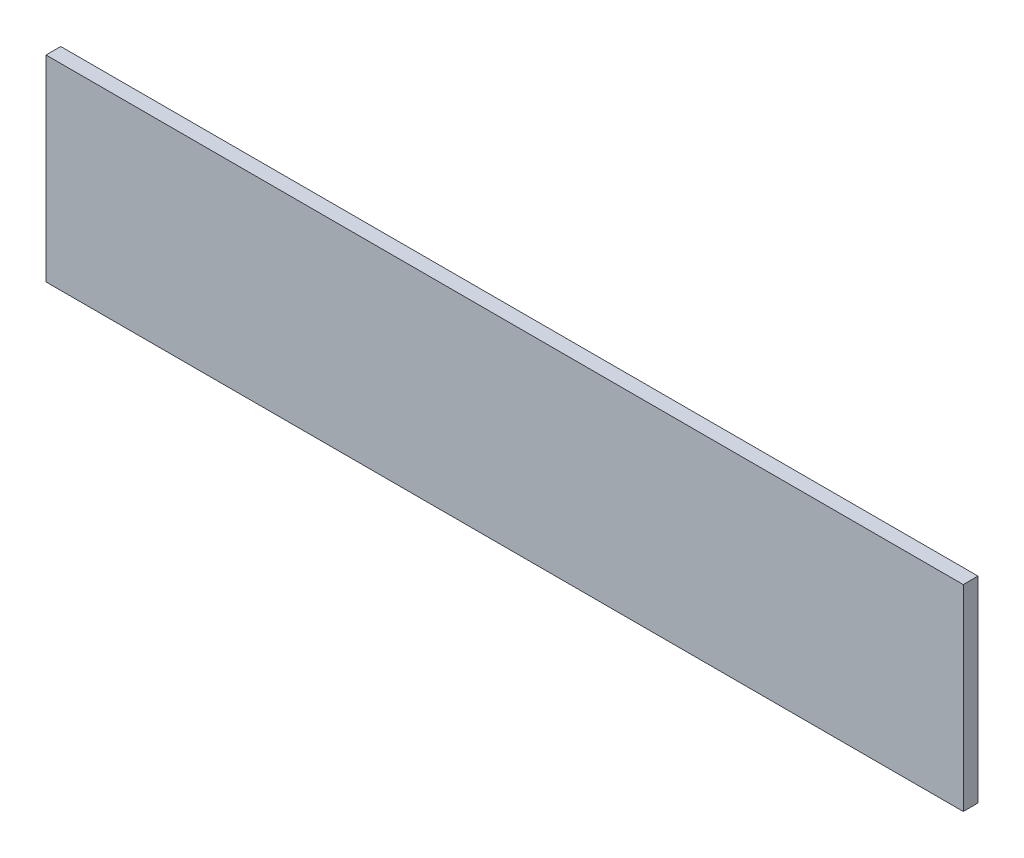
ISO-10303-21;
HEADER;
FILE_DESCRIPTION(('STEP AP214'),'2;1');
FILE_NAME('part.step','',(''),(''),'','','');
FILE_SCHEMA(('AUTOMOTIVE_DESIGN { 1 0 10303 214 1 1 1 1 }'));
ENDSEC;
DATA;
#1=APPLICATION_CONTEXT('core data for automotive mechanical design processes');
#2=APPLICATION_PROTOCOL_DEFINITION('international standard','automotive_design',2000,#1);
#3=PRODUCT_CONTEXT('',#1,'mechanical');
#4=PRODUCT('Part','Part','',(#3));
#5=PRODUCT_RELATED_PRODUCT_CATEGORY('part','',(#4));
#6=PRODUCT_DEFINITION_FORMATION('','',#4);
#7=PRODUCT_DEFINITION_CONTEXT('part definition',#1,'design');
#8=PRODUCT_DEFINITION('design','',#6,#7);
#9=PRODUCT_DEFINITION_SHAPE('','',#8);
#10=(LENGTH_UNIT() NAMED_UNIT(*) SI_UNIT(.MILLI.,.METRE.));
#11=(NAMED_UNIT(*) PLANE_ANGLE_UNIT() SI_UNIT($,.RADIAN.));
#12=(NAMED_UNIT(*) SI_UNIT($,.STERADIAN.) SOLID_ANGLE_UNIT());
#13=UNCERTAINTY_MEASURE_WITH_UNIT(LENGTH_MEASURE(1.E-05),#10,'distance_accuracy_value','');
#14=(GEOMETRIC_REPRESENTATION_CONTEXT(3) GLOBAL_UNCERTAINTY_ASSIGNED_CONTEXT((#13)) GLOBAL_UNIT_ASSIGNED_CONTEXT((#10,
#11,#12)) REPRESENTATION_CONTEXT('',''));
#15=CARTESIAN_POINT('',(0.,0.,0.));
#16=DIRECTION('',(0.,0.,1.));
#17=DIRECTION('',(1.,0.,0.));
#18=AXIS2_PLACEMENT_3D('',#15,#16,#17);
#19=CARTESIAN_POINT('',(-140.,-30.,4.5));
#20=DIRECTION('',(1.,0.,0.));
#21=DIRECTION('',(0.,0.,-1.));
#22=AXIS2_PLACEMENT_3D('',#19,#20,#21);
#23=PLANE('',#22);
#24=DIRECTION('',(0.,-1.,0.));
#25=VECTOR('',#24,1.);
#26=CARTESIAN_POINT('',(-140.,-30.,0.));
#27=LINE('',#26,#25);
#28=CARTESIAN_POINT('',(-140.,30.,0.));
#29=VERTEX_POINT('',#28);
#30=CARTESIAN_POINT('',(-140.,-30.,0.));
#31=VERTEX_POINT('',#30);
#32=EDGE_CURVE('E96',#29,#31,#27,.T.);
#33=ORIENTED_EDGE('',*,*,#32,.T.);
#34=DIRECTION('',(0.,0.,-1.));
#35=VECTOR('',#34,1.);
#36=CARTESIAN_POINT('',(-140.,-30.,4.5));
#37=LINE('',#36,#35);
#38=CARTESIAN_POINT('',(-140.,-30.,4.5));
#39=VERTEX_POINT('',#38);
#40=EDGE_CURVE('E11',#39,#31,#37,.T.);
#41=ORIENTED_EDGE('',*,*,#40,.F.);
#42=DIRECTION('',(0.,-1.,0.));
#43=VECTOR('',#42,1.);
#44=CARTESIAN_POINT('',(-140.,-30.,4.5));
#45=LINE('',#44,#43);
#46=CARTESIAN_POINT('',(-140.,30.,4.5));
#47=VERTEX_POINT('',#46);
#48=EDGE_CURVE('E84',#47,#39,#45,.T.);
#49=ORIENTED_EDGE('',*,*,#48,.F.);
#50=DIRECTION('',(0.,0.,-1.));
#51=VECTOR('',#50,1.);
#52=CARTESIAN_POINT('',(-140.,30.,4.5));
#53=LINE('',#52,#51);
#54=EDGE_CURVE('E92',#47,#29,#53,.T.);
#55=ORIENTED_EDGE('',*,*,#54,.T.);
#56=EDGE_LOOP('',(#33,#41,#49,#55));
#57=FACE_BOUND('',#56,.T.);
#58=ADVANCED_FACE('F33',(#57),#23,.F.);
#59=CARTESIAN_POINT('',(140.,-30.,4.5));
#60=DIRECTION('',(0.,1.,0.));
#61=DIRECTION('',(-1.,0.,0.));
#62=AXIS2_PLACEMENT_3D('',#59,#60,#61);
#63=PLANE('',#62);
#64=DIRECTION('',(1.,0.,0.));
#65=VECTOR('',#64,1.);
#66=CARTESIAN_POINT('',(140.,-30.,0.));
#67=LINE('',#66,#65);
#68=CARTESIAN_POINT('',(140.,-30.,0.));
#69=VERTEX_POINT('',#68);
#70=EDGE_CURVE('E88',#31,#69,#67,.T.);
#71=ORIENTED_EDGE('',*,*,#70,.T.);
#72=DIRECTION('',(0.,0.,-1.));
#73=VECTOR('',#72,1.);
#74=CARTESIAN_POINT('',(140.,-30.,4.5));
#75=LINE('',#74,#73);
#76=CARTESIAN_POINT('',(140.,-30.,4.5));
#77=VERTEX_POINT('',#76);
#78=EDGE_CURVE('E41',#77,#69,#75,.T.);
#79=ORIENTED_EDGE('',*,*,#78,.F.);
#80=DIRECTION('',(1.,0.,0.));
#81=VECTOR('',#80,1.);
#82=CARTESIAN_POINT('',(140.,-30.,4.5));
#83=LINE('',#82,#81);
#84=EDGE_CURVE('E79',#39,#77,#83,.T.);
#85=ORIENTED_EDGE('',*,*,#84,.F.);
#86=ORIENTED_EDGE('',*,*,#40,.T.);
#87=EDGE_LOOP('',(#71,#79,#85,#86));
#88=FACE_BOUND('',#87,.T.);
#89=ADVANCED_FACE('F87',(#88),#63,.F.);
#90=CARTESIAN_POINT('',(140.,-30.,4.5));
#91=DIRECTION('',(-1.,0.,0.));
#92=DIRECTION('',(0.,0.,1.));
#93=AXIS2_PLACEMENT_3D('',#90,#91,#92);
#94=PLANE('',#93);
#95=DIRECTION('',(0.,1.,0.));
#96=VECTOR('',#95,1.);
#97=CARTESIAN_POINT('',(140.,-30.,0.));
#98=LINE('',#97,#96);
#99=CARTESIAN_POINT('',(140.,30.,0.));
#100=VERTEX_POINT('',#99);
#101=EDGE_CURVE('E66',#69,#100,#98,.T.);
#102=ORIENTED_EDGE('',*,*,#101,.T.);
#103=DIRECTION('',(0.,0.,-1.));
#104=VECTOR('',#103,1.);
#105=CARTESIAN_POINT('',(140.,30.,4.5));
#106=LINE('',#105,#104);
#107=CARTESIAN_POINT('',(140.,30.,4.5));
#108=VERTEX_POINT('',#107);
#109=EDGE_CURVE('E89',#108,#100,#106,.T.);
#110=ORIENTED_EDGE('',*,*,#109,.F.);
#111=DIRECTION('',(0.,1.,0.));
#112=VECTOR('',#111,1.);
#113=CARTESIAN_POINT('',(140.,-30.,4.5));
#114=LINE('',#113,#112);
#115=EDGE_CURVE('E82',#77,#108,#114,.T.);
#116=ORIENTED_EDGE('',*,*,#115,.F.);
#117=ORIENTED_EDGE('',*,*,#78,.T.);
#118=EDGE_LOOP('',(#102,#110,#116,#117));
#119=FACE_BOUND('',#118,.T.);
#120=ADVANCED_FACE('F90',(#119),#94,.F.);
#121=CARTESIAN_POINT('',(140.,30.,4.5));
#122=DIRECTION('',(0.,-1.,0.));
#123=DIRECTION('',(1.,0.,0.));
#124=AXIS2_PLACEMENT_3D('',#121,#122,#123);
#125=PLANE('',#124);
#126=DIRECTION('',(-1.,0.,0.));
#127=VECTOR('',#126,1.);
#128=CARTESIAN_POINT('',(140.,30.,0.));
#129=LINE('',#128,#127);
#130=EDGE_CURVE('E72',#100,#29,#129,.T.);
#131=ORIENTED_EDGE('',*,*,#130,.T.);
#132=ORIENTED_EDGE('',*,*,#54,.F.);
#133=DIRECTION('',(-1.,0.,0.));
#134=VECTOR('',#133,1.);
#135=CARTESIAN_POINT('',(140.,30.,4.5));
#136=LINE('',#135,#134);
#137=EDGE_CURVE('E49',#108,#47,#136,.T.);
#138=ORIENTED_EDGE('',*,*,#137,.F.);
#139=ORIENTED_EDGE('',*,*,#109,.T.);
#140=EDGE_LOOP('',(#131,#132,#138,#139));
#141=FACE_BOUND('',#140,.T.);
#142=ADVANCED_FACE('F103',(#141),#125,.F.);
#143=CARTESIAN_POINT('',(0.,0.,4.5));
#144=DIRECTION('',(0.,0.,1.));
#145=DIRECTION('',(1.,0.,0.));
#146=AXIS2_PLACEMENT_3D('',#143,#144,#145);
#147=PLANE('',#146);
#148=ORIENTED_EDGE('',*,*,#48,.T.);
#149=ORIENTED_EDGE('',*,*,#84,.T.);
#150=ORIENTED_EDGE('',*,*,#115,.T.);
#151=ORIENTED_EDGE('',*,*,#137,.T.);
#152=EDGE_LOOP('',(#148,#149,#150,#151));
#153=FACE_BOUND('',#152,.T.);
#154=ADVANCED_FACE('F80',(#153),#147,.T.);
#155=CARTESIAN_POINT('',(0.,0.,0.));
#156=DIRECTION('',(0.,0.,1.));
#157=DIRECTION('',(1.,0.,0.));
#158=AXIS2_PLACEMENT_3D('',#155,#156,#157);
#159=PLANE('',#158);
#160=ORIENTED_EDGE('',*,*,#32,.F.);
#161=ORIENTED_EDGE('',*,*,#130,.F.);
#162=ORIENTED_EDGE('',*,*,#101,.F.);
#163=ORIENTED_EDGE('',*,*,#70,.F.);
#164=EDGE_LOOP('',(#160,#161,#162,#163));
#165=FACE_BOUND('',#164,.T.);
#166=ADVANCED_FACE('F106',(#165),#159,.F.);
#167=CLOSED_SHELL('',(#58,#89,#120,#142,#154,#166));
#168=MANIFOLD_SOLID_BREP('B2',#167);
#169=ADVANCED_BREP_SHAPE_REPRESENTATION('',(#18,#168),#14);
#170=SHAPE_DEFINITION_REPRESENTATION(#9,#169);
ENDSEC;
END-ISO-10303-21;
